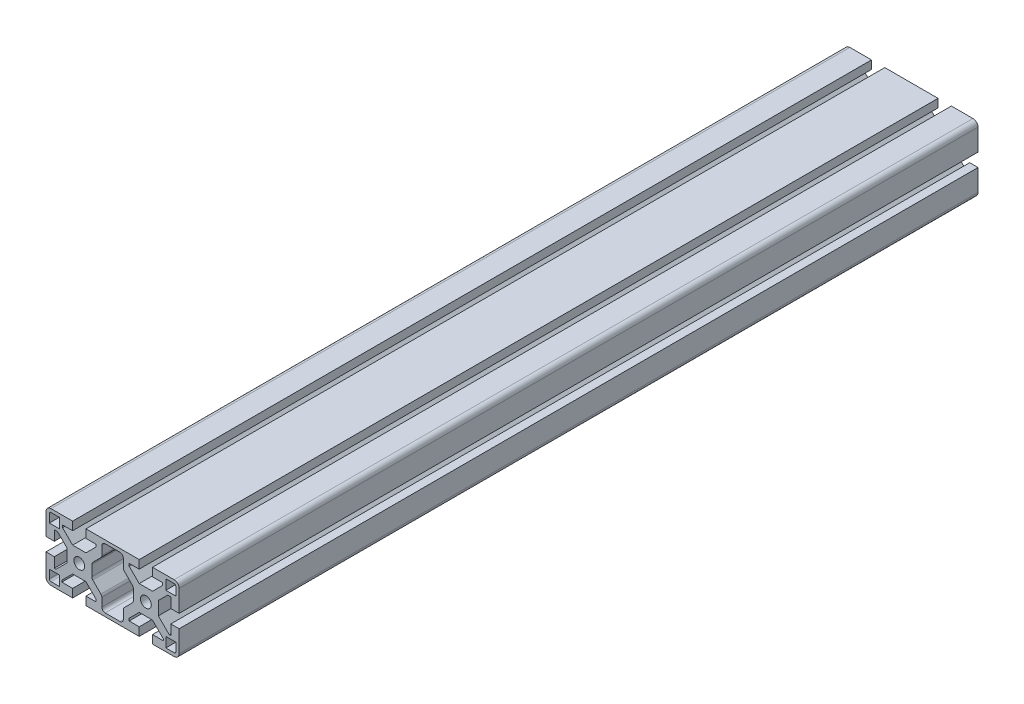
from build123d import *

# Parameters (mm, degrees)
CROQUIS1_R     = 3.25
EXTRUIR5_DEPTH = 480


with BuildPart() as part:
    # Croquis1 → Extruir5 (new body)
    with BuildSketch(Plane.XY):
        with BuildLine():
            Line((50.062875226, 13.55), (50.062875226, 15))
            Line((50.062875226, 15), (44, 15))
            Line((44, 15), (44, 20))
            Line((44, 20), (57, 20))
            ThreePointArc((57, 20), (59.121320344, 19.121320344), (60, 17))
            Line((60, 17), (60, 4))
            Line((60, 4), (55, 4))
            Line((55, 4), (55, 10.05))
            Line((55, 10.05), (53.1, 10.05))
            Line((53.1, 10.05), (47.5, 4.45))
            Line((47.5, 4.45), (47.5, -3.55))
            Line((47.5, -3.55), (54, -10.05))
            Line((54, -10.05), (55, -10.05))
            Line((55, -10.05), (55, -4))
            Line((55, -4), (60, -4))
            Line((60, -4), (60, -17))
            ThreePointArc((60, -17), (59.121320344, -19.121320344), (57, -20))
            Line((57, -20), (44, -20))
            Line((44, -20), (44, -15))
            Line((44, -15), (50.5, -15))
            Line((50.5, -15), (50.5, -14))
            Line((50.5, -14), (44, -7.5))
            Line((44, -7.5), (36, -7.5))
            Line((36, -7.5), (29.95, -13.55))
            Line((29.95, -13.55), (29.95, -15))
            Line((29.95, -15), (36, -15))
            Line((36, -15), (36, -20))
            Line((36, -20), (4, -20))
            Line((4, -20), (4, -15))
            Line((4, -15), (10.05, -15))
            Line((10.05, -15), (10.05, -13.55))
            Line((10.05, -13.55), (4, -7.5))
            Line((4, -7.5), (-4, -7.5))
            Line((-4, -7.5), (-10.5, -14))
            Line((-10.5, -14), (-10.5, -15))
            Line((-10.5, -15), (-4, -15))
            Line((-4, -15), (-4, -20))
            Line((-4, -20), (-17, -20))
            ThreePointArc((-17, -20), (-19.121320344, -19.121320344), (-20, -17))
            Line((-20, -17), (-20, -4))
            Line((-20, -4), (-15, -4))
            Line((-15, -4), (-15, -10.05))
            Line((-15, -10.05), (-14, -10.05))
            Line((-14, -10.05), (-7.5, -3.55))
            Line((-7.5, -3.55), (-7.5, 4.45))
            Line((-7.5, 4.45), (-13.1, 10.05))
            Line((-13.1, 10.05), (-15, 10.05))
            Line((-15, 10.05), (-15, 4))
            Line((-15, 4), (-20, 4))
            Line((-20, 4), (-20, 17))
            ThreePointArc((-20, 17), (-19.121320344, 19.121320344), (-17, 20))
            Line((-17, 20), (-4, 20))
            Line((-4, 20), (-4, 15))
            Line((-4, 15), (-10.062875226, 15))
            Line((-10.062875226, 15), (-10.062875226, 13.55))
            Line((-10.062875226, 13.55), (-4, 7.5))
            Line((-4, 7.5), (4, 7.5))
            Line((4, 7.5), (10.05, 13.55))
            Line((10.05, 13.55), (10.05, 15))
            Line((10.05, 15), (4, 15))
            Line((4, 15), (4, 20))
            Line((4, 20), (36, 20))
            Line((36, 20), (36, 15))
            Line((36, 15), (29.95, 15))
            Line((29.95, 15), (29.95, 13.55))
            Line((29.95, 13.55), (36, 7.5))
            Line((36, 7.5), (44, 7.5))
            Line((44, 7.5), (50.062875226, 13.55))
        make_face()
        Circle(CROQUIS1_R, mode=Mode.SUBTRACT)
        with Locations(Location((40, 0, 0), (0, 0, 180))):
            Circle(CROQUIS1_R, mode=Mode.SUBTRACT)
        with BuildLine():
            Line((-18, 12), (-12, 12))
            Line((-12, 12), (-12, 18))
            Line((-12, 18), (-17, 18))
            ThreePointArc((-17, 18), (-17.707106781, 17.707106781), (-18, 17))
            Line((-18, 17), (-18, 12))
        make_face(mode=Mode.SUBTRACT)
        with BuildLine():
            Line((24.45, 18), (15.55, 18))
            ThreePointArc((15.55, 18), (14.135786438, 17.414213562), (13.55, 16))
            Line((13.55, 16), (13.55, 10.878427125))
            ThreePointArc((13.55, 10.878427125), (13.397759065, 10.11306026), (12.964213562, 9.464213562))
            Line((12.964213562, 9.464213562), (8.085786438, 4.585786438))
            ThreePointArc((8.085786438, 4.585786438), (7.652240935, 3.93693974), (7.5, 3.171572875))
            Line((7.5, 3.171572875), (7.5, -3.171572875))
            ThreePointArc((7.5, -3.171572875), (7.652240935, -3.93693974), (8.085786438, -4.585786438))
            Line((8.085786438, -4.585786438), (12.964213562, -9.464213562))
            ThreePointArc((12.964213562, -9.464213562), (13.397759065, -10.11306026), (13.55, -10.878427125))
            Line((13.55, -10.878427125), (13.55, -16))
            ThreePointArc((13.55, -16), (14.135786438, -17.414213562), (15.55, -18))
            Line((15.55, -18), (24.45, -18))
            ThreePointArc((24.45, -18), (25.864213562, -17.414213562), (26.45, -16))
            Line((26.45, -16), (26.45, -10.878427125))
            ThreePointArc((26.45, -10.878427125), (26.602240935, -10.11306026), (27.035786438, -9.464213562))
            Line((27.035786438, -9.464213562), (31.914213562, -4.585786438))
            ThreePointArc((31.914213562, -4.585786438), (32.347759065, -3.93693974), (32.5, -3.171572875))
            Line((32.5, -3.171572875), (32.5, 3.171572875))
            ThreePointArc((32.5, 3.171572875), (32.347759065, 3.93693974), (31.914213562, 4.585786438))
            Line((31.914213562, 4.585786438), (27.035786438, 9.464213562))
            ThreePointArc((27.035786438, 9.464213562), (26.602240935, 10.11306026), (26.45, 10.878427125))
            Line((26.45, 10.878427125), (26.45, 16))
            ThreePointArc((26.45, 16), (25.864213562, 17.414213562), (24.45, 18))
        make_face(mode=Mode.SUBTRACT)
        with BuildLine():
            Line((-17, -18), (-12, -18))
            Line((-12, -18), (-12, -12))
            Line((-12, -12), (-18, -12))
            Line((-18, -12), (-18, -17))
            ThreePointArc((-18, -17), (-17.707106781, -17.707106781), (-17, -18))
        make_face(mode=Mode.SUBTRACT)
        with BuildLine():
            Line((58, -17), (58, -12))
            Line((58, -12), (52, -12))
            Line((52, -12), (52, -18))
            Line((52, -18), (57, -18))
            ThreePointArc((57, -18), (57.707106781, -17.707106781), (58, -17))
        make_face(mode=Mode.SUBTRACT)
        with BuildLine():
            Line((58, 12), (58, 17))
            ThreePointArc((58, 17), (57.707106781, 17.707106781), (57, 18))
            Line((57, 18), (52, 18))
            Line((52, 18), (52, 12))
            Line((52, 12), (58, 12))
        make_face(mode=Mode.SUBTRACT)
    extrude(amount=EXTRUIR5_DEPTH)


solid = part.part
